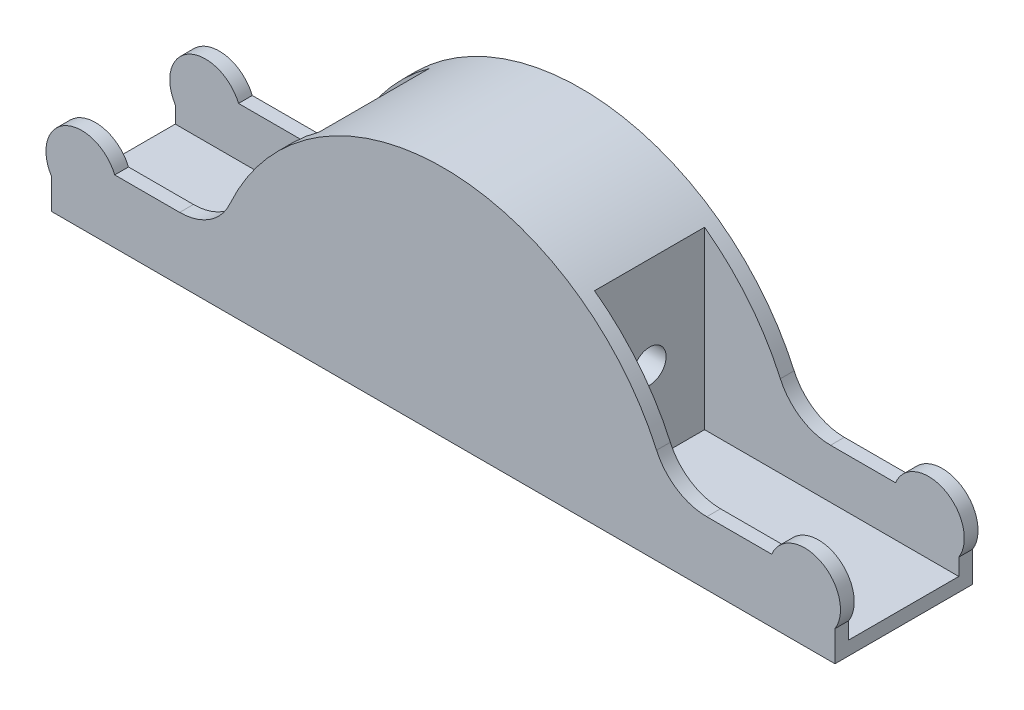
from build123d import *

# Parameters (mm, degrees)
BOSS_EXTRUDE1_DEPTH = 250
CUT_EXTRUDE1_START  = -25
SKETCH2_W           = 472
SKETCH2_H           = 200
CUT_EXTRUDE1_DEPTH  = 596
SKETCH3_R           = 30
CUT_EXTRUDE2_DEPTH  = 596


with BuildPart() as part:
    # Sketch1 → Boss-Extrude1 (new body)
    with BuildSketch(Plane.XY):
        with BuildLine():
            Line((-712, 0), (712, 0))
            Line((712, 0), (712, 55.358983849))
            ThreePointArc((712, 55.358983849), (686.925118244, 147.701709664), (597, 115))
            Line((597, 115), (478.957200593, 115))
            ThreePointArc((478.957200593, 115), (424.621384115, 131.049901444), (387.727257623, 174.047619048))
            ThreePointArc((387.727257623, 174.047619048), (0, 425), (-387.727257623, 174.047619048))
            ThreePointArc((-387.727257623, 174.047619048), (-424.621384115, 131.049901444), (-478.957200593, 115))
            Line((-478.957200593, 115), (-597, 115))
            ThreePointArc((-597, 115), (-686.925118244, 147.701709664), (-712, 55.358983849))
            Line((-712, 55.358983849), (-712, 0))
        make_face()
    extrude(amount=BOSS_EXTRUDE1_DEPTH)

    # Sketch2 → Cut-Extrude1 (cut)
    with BuildSketch(Plane.XZ.offset(CUT_EXTRUDE1_START)):
        with Locations((-486, 125)):
            Rectangle(SKETCH2_W, SKETCH2_H)
        with Locations((486, 125)):
            Rectangle(SKETCH2_W, SKETCH2_H)
    extrude(amount=-CUT_EXTRUDE1_DEPTH, mode=Mode.SUBTRACT)

    # Sketch3 → Cut-Extrude2 (cut)
    with BuildSketch(Plane.ZY.offset(250)):
        with Locations((125, 175)):
            Circle(SKETCH3_R)
    extrude(amount=-CUT_EXTRUDE2_DEPTH, mode=Mode.SUBTRACT)


solid = part.part
